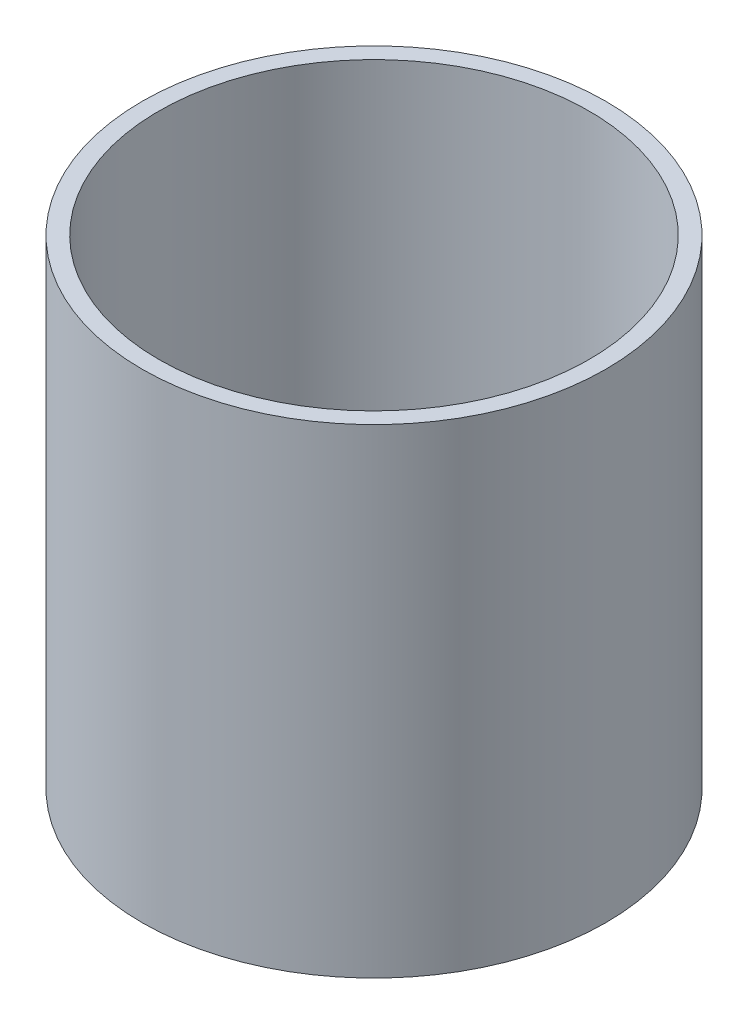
from build123d import *

# Parameters (mm, degrees)
SKETCH1_R           = 13.827
SKETCH1_R_2         = 12.827
BOSS_EXTRUDE1_DEPTH = 28.575


with BuildPart() as part:
    # Sketch1 → Boss-Extrude1 (new body)
    with BuildSketch(Plane(origin=(0, 0, 0), x_dir=(1, 0, 0), z_dir=(0, 1, 0))):
        with Locations(Location((0, 0, 0), (0, 0, 270))):
            Circle(SKETCH1_R)
        with Locations(Location((0, 0, 0), (0, 0, 270))):
            Circle(SKETCH1_R_2, mode=Mode.SUBTRACT)
    extrude(amount=BOSS_EXTRUDE1_DEPTH)


solid = part.part
